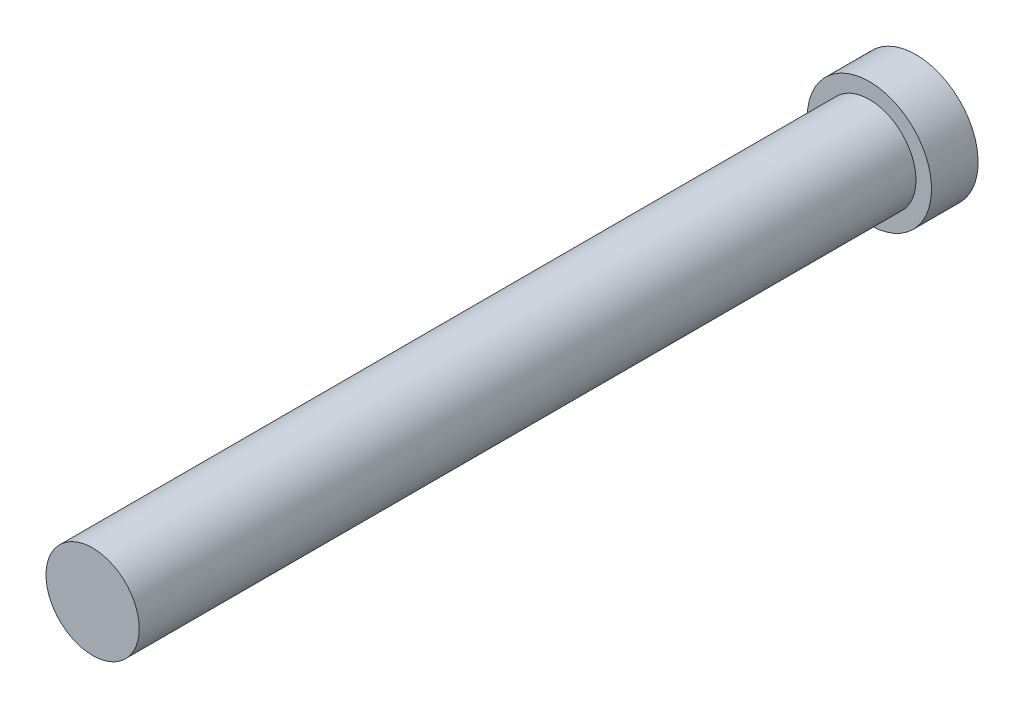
from build123d import *

# Parameters (mm, degrees)
SKETCH_1_R          = 1.5
EXTRUDE_1_DEPTH     = 25
SKETCH_2_R          = 2
EXTRUDE_2_DEPTH     = 1.5
CUT_EXTRUDE_1_DEPTH = 1


with BuildPart() as part:
    # Sketch 1 → Extrude 1 (new body)
    with BuildSketch(Plane.XY):
        Circle(SKETCH_1_R)
    extrude(amount=EXTRUDE_1_DEPTH)

    # Sketch 2 → Extrude 2 (add)
    with BuildSketch(Plane(origin=(0, 0, 0), x_dir=(-1, 0, 0), z_dir=(0, 0, -1))):
        Circle(SKETCH_2_R)
    extrude(amount=EXTRUDE_2_DEPTH)

    # Sketch 3 → Cut-Extrude 1 (cut)
    with BuildSketch(Plane(origin=(0, 0, -1.5), x_dir=(-1, 0, 0), z_dir=(0, 0, -1))):
        Polygon((-0.29679589, 0.304992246), (-1.735679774, 0.304992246), (-1.735679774, -0.304992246), (-0.29679589, -0.304992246), (-0.29679589, -1.689035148), (0.29679589, -1.689035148), (0.29679589, -0.304992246), (1.735679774, -0.304992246), (1.735679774, 0.304992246), (0.29679589, 0.304992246), (0.29679589, 1.689035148), (-0.29679589, 1.689035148), align=None)
    extrude(amount=-CUT_EXTRUDE_1_DEPTH, mode=Mode.SUBTRACT)


solid = part.part
